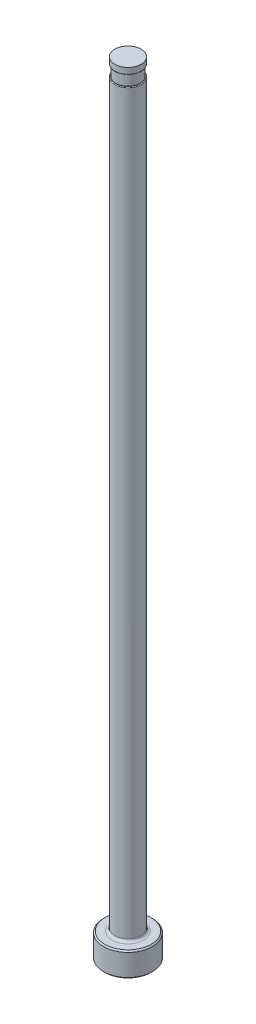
from build123d import *

# Parameters (mm, degrees)
CHAMFER1_SIZE     = 0.254
FILLET1_R         = 0.508
SKETCH2_W         = 0.2032
SKETCH2_H         = 2.032
D_SLOT_DEPTH      = 153.548755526
D_SLOT_DEPTH_BACK = 153.548755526
SKETCH5_W         = 0.01905
SKETCH5_H         = 1.27
FILLET2_R         = 0.127


with BuildPart() as part:
    # Sketch1 → Revolve1 (revolve)
    with BuildSketch(Plane.XY, mode=Mode.PRIVATE) as revolve1_sk:
        Polygon((0, 0), (-4.7625, 0), (-4.7625, 4.7498), (-2.57937, 4.7498), (-2.57937, 152.4), (0, 152.4), align=None)
    revolve(revolve1_sk.sketch.rotate(Axis((0, 259.958771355, 0), (0, -1, 0)), 270), axis=Axis((0, 259.958771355, 0), (0, -1, 0)))

    # Chamfer1
    chamfer1_edges = [part.edges().sort_by_distance(p)[0] for p in [
        (0, 4.7498, -4.7625),
        (0, 0, -4.7625),
    ]]
    chamfer(chamfer1_edges, length=CHAMFER1_SIZE)

    # Fillet1
    fillet1_edges = [part.edges().sort_by_distance(p)[0] for p in [
        (0, 4.7498, -2.57937),
    ]]
    fillet(fillet1_edges, radius=FILLET1_R)

    # Sketch2 → Vent Relief (revolve, cut)
    with BuildSketch(Plane.XY, mode=Mode.PRIVATE) as vent_relief_sk:
        with Locations((-2.47777, 150.114)):
            Rectangle(SKETCH2_W, SKETCH2_H)
    revolve(vent_relief_sk.sketch.rotate(Axis((0, 153.448281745, 0), (0, -1, 0)), 270), axis=Axis((0, 153.448281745, 0), (0, -1, 0)), mode=Mode.SUBTRACT)

    # Sketch3 → D-Slot (cut, two sides: drawn at the far end of the back side and taken through both)
    with BuildSketch(Plane.XY.offset(-D_SLOT_DEPTH_BACK)):
        with BuildLine():
            Line((-2.37617, 150.114), (-2.37617, 86.614))
            ThreePointArc((-2.37617, 86.614), (-2.427383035, 86.046038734), (-2.57937, 85.4964))
            Line((-2.57937, 85.4964), (-2.57937, 150.114))
            Line((-2.57937, 150.114), (-2.37617, 150.114))
        make_face()
    extrude(amount=D_SLOT_DEPTH + D_SLOT_DEPTH_BACK, mode=Mode.SUBTRACT)

    # Sketch5 → Vent Diameter (revolve, cut)
    with BuildSketch(Plane.XY, mode=Mode.PRIVATE) as vent_diameter_sk:
        with Locations((-2.569845, 151.765)):
            Rectangle(SKETCH5_W, SKETCH5_H)
    revolve(vent_diameter_sk.sketch.rotate(Axis((0, 152.687735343, 0), (0, -1, 0)), 90), axis=Axis((0, 152.687735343, 0), (0, -1, 0)), mode=Mode.SUBTRACT)

    # Fillet2
    fillet2_edges = [part.edges().sort_by_distance(p)[0] for p in [
        (2.149591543, 149.098, -1.425624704),
        (0, 151.13, 2.56032),
    ]]
    fillet(fillet2_edges, radius=FILLET2_R)


solid = part.part
